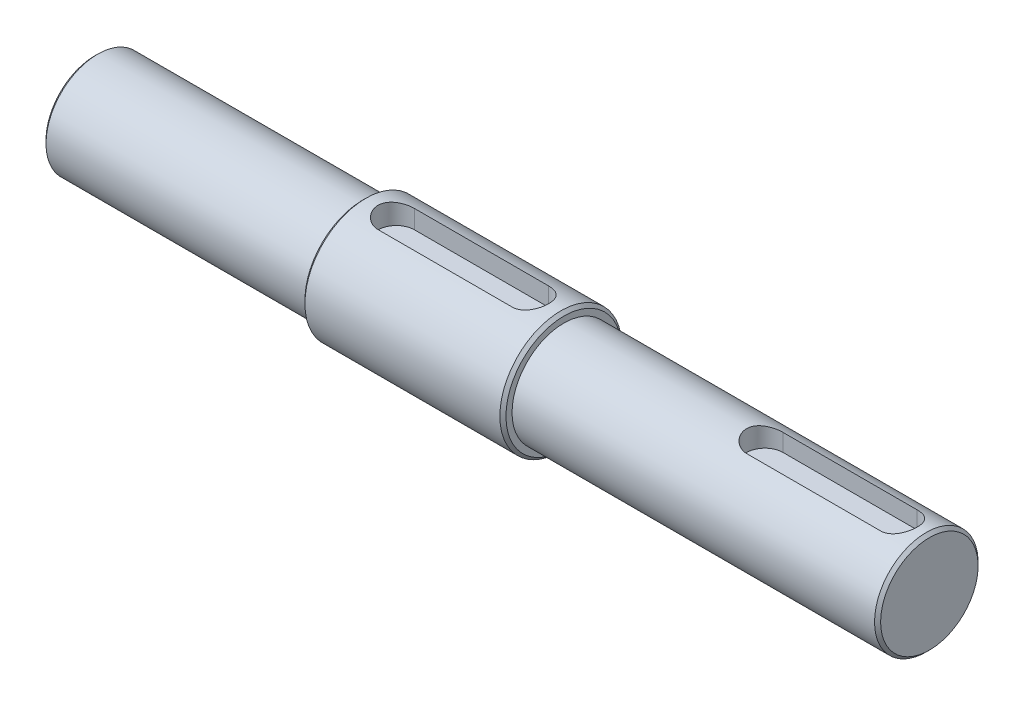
from build123d import *

# Parameters (mm, degrees)
CUT_EXTRUDE1_DEPTH = 10
CUT_EXTRUDE2_DEPTH = 10
CHAMFER1_SIZE      = 0.5


with BuildPart() as part:
    # Sketch1 → Revolve1 (revolve)
    with BuildSketch(Plane.XY, mode=Mode.PRIVATE) as revolve1_sk:
        Polygon((0, 0), (0, 8.5), (44, 8.5), (44, 10), (77, 10), (77, 8.5), (137, 8.5), (137, 0), align=None)
    revolve(revolve1_sk.sketch.rotate(Axis((0, 0, 0), (1, 0, 0)), 90), axis=Axis((0, 0, 0), (1, 0, 0)))

    # Sketch2 → Cut-Extrude1 (cut)
    with BuildSketch(Plane(origin=(0, 5.1, 0), x_dir=(1, 0, 0), z_dir=(0, 1, 0))):
        with BuildLine():
            Line((132, -3), (110, -3))
            ThreePointArc((110, -3), (107, 0), (110, 3))
            Line((110, 3), (132, 3))
            ThreePointArc((132, 3), (135, 0), (132, -3))
        make_face()
    extrude(amount=CUT_EXTRUDE1_DEPTH, mode=Mode.SUBTRACT)

    # Sketch3 → Cut-Extrude2 (cut)
    with BuildSketch(Plane(origin=(0, 6.5, 0), x_dir=(1, 0, 0), z_dir=(0, 1, 0))):
        with BuildLine():
            Line((71.5, -3), (49.5, -3))
            ThreePointArc((49.5, -3), (46.5, 0), (49.5, 3))
            Line((49.5, 3), (71.5, 3))
            ThreePointArc((71.5, 3), (74.5, 0), (71.5, -3))
        make_face()
    extrude(amount=CUT_EXTRUDE2_DEPTH, mode=Mode.SUBTRACT)

    # Chamfer1
    chamfer1_edges = [part.edges().sort_by_distance(p)[0] for p in [
        (137, 0, -8.5),
        (77, 0, -10),
        (44, 0, -10),
        (0, 0, -8.5),
    ]]
    chamfer(chamfer1_edges, length=CHAMFER1_SIZE)


solid = part.part
